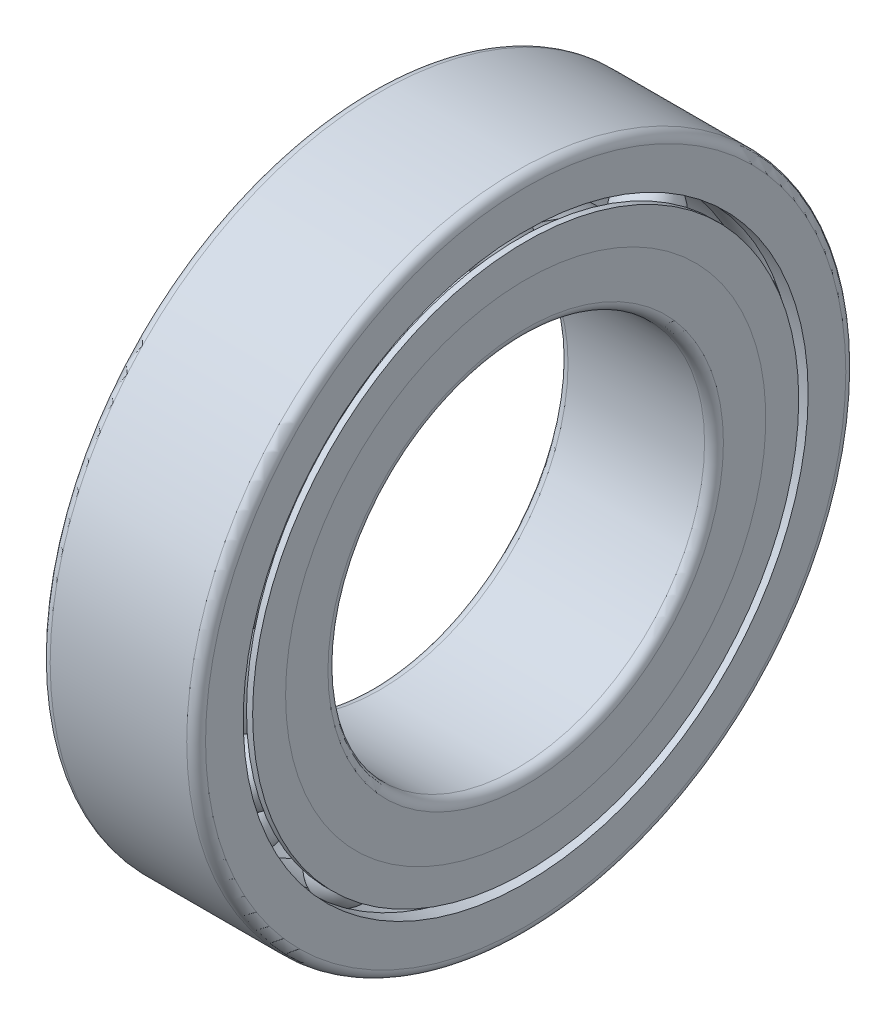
ISO-10303-21;
HEADER;
FILE_DESCRIPTION(('STEP AP214'),'2;1');
FILE_NAME('part.step','',(''),(''),'','','');
FILE_SCHEMA(('AUTOMOTIVE_DESIGN { 1 0 10303 214 1 1 1 1 }'));
ENDSEC;
DATA;
#1=APPLICATION_CONTEXT('core data for automotive mechanical design processes');
#2=APPLICATION_PROTOCOL_DEFINITION('international standard','automotive_design',2000,#1);
#3=PRODUCT_CONTEXT('',#1,'mechanical');
#4=PRODUCT('Part','Part','',(#3));
#5=PRODUCT_RELATED_PRODUCT_CATEGORY('part','',(#4));
#6=PRODUCT_DEFINITION_FORMATION('','',#4);
#7=PRODUCT_DEFINITION_CONTEXT('part definition',#1,'design');
#8=PRODUCT_DEFINITION('design','',#6,#7);
#9=PRODUCT_DEFINITION_SHAPE('','',#8);
#10=(LENGTH_UNIT() NAMED_UNIT(*) SI_UNIT(.MILLI.,.METRE.));
#11=(NAMED_UNIT(*) PLANE_ANGLE_UNIT() SI_UNIT($,.RADIAN.));
#12=(NAMED_UNIT(*) SI_UNIT($,.STERADIAN.) SOLID_ANGLE_UNIT());
#13=UNCERTAINTY_MEASURE_WITH_UNIT(LENGTH_MEASURE(1.E-05),#10,'distance_accuracy_value','');
#14=(GEOMETRIC_REPRESENTATION_CONTEXT(3) GLOBAL_UNCERTAINTY_ASSIGNED_CONTEXT((#13)) GLOBAL_UNIT_ASSIGNED_CONTEXT((#10,
#11,#12)) REPRESENTATION_CONTEXT('',''));
#15=CARTESIAN_POINT('',(0.,0.,0.));
#16=DIRECTION('',(0.,0.,1.));
#17=DIRECTION('',(1.,0.,0.));
#18=AXIS2_PLACEMENT_3D('',#15,#16,#17);
#19=CARTESIAN_POINT('',(0.,0.,0.));
#20=DIRECTION('',(1.,0.,0.));
#21=DIRECTION('',(0.,0.,1.));
#22=AXIS2_PLACEMENT_3D('',#19,#20,#21);
#23=CYLINDRICAL_SURFACE('',#22,58.);
#24=CARTESIAN_POINT('',(16.5,0.,0.));
#25=DIRECTION('',(-1.,0.,0.));
#26=DIRECTION('',(0.,0.,1.));
#27=AXIS2_PLACEMENT_3D('',#24,#25,#26);
#28=CIRCLE('',#27,58.);
#29=CARTESIAN_POINT('',(16.5,0.,58.));
#30=VERTEX_POINT('',#29);
#31=EDGE_CURVE('E50',#30,#30,#28,.T.);
#32=ORIENTED_EDGE('',*,*,#31,.T.);
#33=EDGE_LOOP('',(#32));
#34=FACE_BOUND('',#33,.T.);
#35=CARTESIAN_POINT('',(15.1961524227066,0.,0.));
#36=DIRECTION('',(-1.,0.,0.));
#37=DIRECTION('',(0.,0.,1.));
#38=AXIS2_PLACEMENT_3D('',#35,#36,#37);
#39=CIRCLE('',#38,58.);
#40=CARTESIAN_POINT('',(15.1961524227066,0.,58.));
#41=VERTEX_POINT('',#40);
#42=EDGE_CURVE('E11',#41,#41,#39,.T.);
#43=ORIENTED_EDGE('',*,*,#42,.F.);
#44=EDGE_LOOP('',(#43));
#45=FACE_BOUND('',#44,.T.);
#46=ADVANCED_FACE('F36',(#34,#45),#23,.T.);
#47=CARTESIAN_POINT('',(10.,0.,0.));
#48=DIRECTION('',(1.,0.,0.));
#49=DIRECTION('',(0.,0.,1.));
#50=AXIS2_PLACEMENT_3D('',#47,#48,#49);
#51=TOROIDAL_SURFACE('',#50,55.,6.);
#52=ORIENTED_EDGE('',*,*,#42,.T.);
#53=EDGE_LOOP('',(#52));
#54=FACE_BOUND('',#53,.T.);
#55=CARTESIAN_POINT('',(14.4721359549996,0.,0.));
#56=DIRECTION('',(-1.,0.,0.));
#57=DIRECTION('',(0.,0.,1.));
#58=AXIS2_PLACEMENT_3D('',#55,#56,#57);
#59=CIRCLE('',#58,51.);
#60=CARTESIAN_POINT('',(14.4721359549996,0.,51.));
#61=VERTEX_POINT('',#60);
#62=EDGE_CURVE('E42',#61,#61,#59,.T.);
#63=ORIENTED_EDGE('',*,*,#62,.F.);
#64=EDGE_LOOP('',(#63));
#65=FACE_BOUND('',#64,.T.);
#66=ADVANCED_FACE('F66',(#54,#65),#51,.F.);
#67=CARTESIAN_POINT('',(0.,0.,0.));
#68=DIRECTION('',(1.,0.,0.));
#69=DIRECTION('',(0.,0.,1.));
#70=AXIS2_PLACEMENT_3D('',#67,#68,#69);
#71=CYLINDRICAL_SURFACE('',#70,51.);
#72=ORIENTED_EDGE('',*,*,#62,.T.);
#73=EDGE_LOOP('',(#72));
#74=FACE_BOUND('',#73,.T.);
#75=CARTESIAN_POINT('',(16.5,0.,0.));
#76=DIRECTION('',(-1.,0.,0.));
#77=DIRECTION('',(0.,0.,1.));
#78=AXIS2_PLACEMENT_3D('',#75,#76,#77);
#79=CIRCLE('',#78,51.);
#80=CARTESIAN_POINT('',(16.5,0.,51.));
#81=VERTEX_POINT('',#80);
#82=EDGE_CURVE('E46',#81,#81,#79,.T.);
#83=ORIENTED_EDGE('',*,*,#82,.F.);
#84=EDGE_LOOP('',(#83));
#85=FACE_BOUND('',#84,.T.);
#86=ADVANCED_FACE('F60',(#74,#85),#71,.F.);
#87=CARTESIAN_POINT('',(16.5,58.,0.));
#88=DIRECTION('',(-1.,0.,0.));
#89=DIRECTION('',(0.,0.,-1.));
#90=AXIS2_PLACEMENT_3D('',#87,#88,#89);
#91=PLANE('',#90);
#92=ORIENTED_EDGE('',*,*,#82,.T.);
#93=EDGE_LOOP('',(#92));
#94=FACE_BOUND('',#93,.T.);
#95=ORIENTED_EDGE('',*,*,#31,.F.);
#96=EDGE_LOOP('',(#95));
#97=FACE_BOUND('',#96,.T.);
#98=ADVANCED_FACE('F58',(#94,#97),#91,.F.);
#99=CLOSED_SHELL('',(#46,#66,#86,#98));
#100=MANIFOLD_SOLID_BREP('B2',#99);
#101=CARTESIAN_POINT('',(-10.,44.4959346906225,32.3281888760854));
#102=DIRECTION('',(-1.,0.,0.));
#103=DIRECTION('',(0.,0.809016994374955,0.587785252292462));
#104=AXIS2_PLACEMENT_3D('',#101,#102,#103);
#105=SPHERICAL_SURFACE('',#104,6.);
#106=CARTESIAN_POINT('',(-16.,44.4959346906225,32.3281888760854));
#107=VERTEX_POINT('',#106);
#108=VERTEX_LOOP('',#107);
#109=FACE_BOUND('',#108,.T.);
#110=ADVANCED_FACE('F104',(#109),#105,.T.);
#111=CLOSED_SHELL('',(#110));
#112=MANIFOLD_SOLID_BREP('B6',#111);
#113=CARTESIAN_POINT('',(-10.,16.9959346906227,52.3081083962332));
#114=DIRECTION('',(-1.,0.,0.));
#115=DIRECTION('',(0.,0.309016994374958,0.95105651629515));
#116=AXIS2_PLACEMENT_3D('',#113,#114,#115);
#117=SPHERICAL_SURFACE('',#116,6.);
#118=CARTESIAN_POINT('',(-16.,16.9959346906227,52.3081083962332));
#119=VERTEX_POINT('',#118);
#120=VERTEX_LOOP('',#119);
#121=FACE_BOUND('',#120,.T.);
#122=ADVANCED_FACE('F123',(#121),#117,.T.);
#123=CLOSED_SHELL('',(#122));
#124=MANIFOLD_SOLID_BREP('B32',#123);
#125=CARTESIAN_POINT('',(-10.,-16.9959346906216,52.3081083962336));
#126=DIRECTION('',(-1.,0.,0.));
#127=DIRECTION('',(0.,-0.309016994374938,0.951056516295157));
#128=AXIS2_PLACEMENT_3D('',#125,#126,#127);
#129=SPHERICAL_SURFACE('',#128,6.);
#130=CARTESIAN_POINT('',(-16.,-16.9959346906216,52.3081083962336));
#131=VERTEX_POINT('',#130);
#132=VERTEX_LOOP('',#131);
#133=FACE_BOUND('',#132,.T.);
#134=ADVANCED_FACE('F142',(#133),#129,.T.);
#135=CLOSED_SHELL('',(#134));
#136=MANIFOLD_SOLID_BREP('B100',#135);
#137=CARTESIAN_POINT('',(-10.,-44.4959346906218,32.3281888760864));
#138=DIRECTION('',(-1.,0.,0.));
#139=DIRECTION('',(0.,-0.809016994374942,0.58778525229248));
#140=AXIS2_PLACEMENT_3D('',#137,#138,#139);
#141=SPHERICAL_SURFACE('',#140,6.);
#142=CARTESIAN_POINT('',(-16.,-44.4959346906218,32.3281888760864));
#143=VERTEX_POINT('',#142);
#144=VERTEX_LOOP('',#143);
#145=FACE_BOUND('',#144,.T.);
#146=ADVANCED_FACE('F161',(#145),#141,.T.);
#147=CLOSED_SHELL('',(#146));
#148=MANIFOLD_SOLID_BREP('B119',#147);
#149=CARTESIAN_POINT('',(-10.,-55.,3.84063169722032E-13));
#150=DIRECTION('',(-1.,0.,0.));
#151=DIRECTION('',(0.,-1.,0.));
#152=AXIS2_PLACEMENT_3D('',#149,#150,#151);
#153=SPHERICAL_SURFACE('',#152,6.);
#154=CARTESIAN_POINT('',(-16.,-55.,3.84063169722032E-13));
#155=VERTEX_POINT('',#154);
#156=VERTEX_LOOP('',#155);
#157=FACE_BOUND('',#156,.T.);
#158=ADVANCED_FACE('F180',(#157),#153,.T.);
#159=CLOSED_SHELL('',(#158));
#160=MANIFOLD_SOLID_BREP('B138',#159);
#161=CARTESIAN_POINT('',(-10.,-44.4959346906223,-32.3281888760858));
#162=DIRECTION('',(-1.,0.,0.));
#163=DIRECTION('',(0.,-0.809016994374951,-0.587785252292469));
#164=AXIS2_PLACEMENT_3D('',#161,#162,#163);
#165=SPHERICAL_SURFACE('',#164,6.);
#166=CARTESIAN_POINT('',(-16.,-44.4959346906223,-32.3281888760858));
#167=VERTEX_POINT('',#166);
#168=VERTEX_LOOP('',#167);
#169=FACE_BOUND('',#168,.T.);
#170=ADVANCED_FACE('F199',(#169),#165,.T.);
#171=CLOSED_SHELL('',(#170));
#172=MANIFOLD_SOLID_BREP('B157',#171);
#173=CARTESIAN_POINT('',(-10.,-16.9959346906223,-52.3081083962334));
#174=DIRECTION('',(-1.,0.,0.));
#175=DIRECTION('',(0.,-0.309016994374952,-0.951056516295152));
#176=AXIS2_PLACEMENT_3D('',#173,#174,#175);
#177=SPHERICAL_SURFACE('',#176,6.);
#178=CARTESIAN_POINT('',(-16.,-16.9959346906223,-52.3081083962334));
#179=VERTEX_POINT('',#178);
#180=VERTEX_LOOP('',#179);
#181=FACE_BOUND('',#180,.T.);
#182=ADVANCED_FACE('F218',(#181),#177,.T.);
#183=CLOSED_SHELL('',(#182));
#184=MANIFOLD_SOLID_BREP('B176',#183);
#185=CARTESIAN_POINT('',(-10.,16.995934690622,-52.3081083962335));
#186=DIRECTION('',(-1.,0.,0.));
#187=DIRECTION('',(0.,0.309016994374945,-0.951056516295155));
#188=AXIS2_PLACEMENT_3D('',#185,#186,#187);
#189=SPHERICAL_SURFACE('',#188,6.);
#190=CARTESIAN_POINT('',(-16.,16.995934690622,-52.3081083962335));
#191=VERTEX_POINT('',#190);
#192=VERTEX_LOOP('',#191);
#193=FACE_BOUND('',#192,.T.);
#194=ADVANCED_FACE('F237',(#193),#189,.T.);
#195=CLOSED_SHELL('',(#194));
#196=MANIFOLD_SOLID_BREP('B195',#195);
#197=CARTESIAN_POINT('',(-10.,44.4959346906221,-32.3281888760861));
#198=DIRECTION('',(-1.,0.,0.));
#199=DIRECTION('',(0.,0.809016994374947,-0.587785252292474));
#200=AXIS2_PLACEMENT_3D('',#197,#198,#199);
#201=SPHERICAL_SURFACE('',#200,6.);
#202=CARTESIAN_POINT('',(-16.,44.4959346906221,-32.3281888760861));
#203=VERTEX_POINT('',#202);
#204=VERTEX_LOOP('',#203);
#205=FACE_BOUND('',#204,.T.);
#206=ADVANCED_FACE('F256',(#205),#201,.T.);
#207=CLOSED_SHELL('',(#206));
#208=MANIFOLD_SOLID_BREP('B214',#207);
#209=CARTESIAN_POINT('',(10.,44.4959346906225,32.3281888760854));
#210=DIRECTION('',(-1.,0.,0.));
#211=DIRECTION('',(0.,0.809016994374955,0.587785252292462));
#212=AXIS2_PLACEMENT_3D('',#209,#210,#211);
#213=SPHERICAL_SURFACE('',#212,6.);
#214=CARTESIAN_POINT('',(4.,44.4959346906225,32.3281888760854));
#215=VERTEX_POINT('',#214);
#216=VERTEX_LOOP('',#215);
#217=FACE_BOUND('',#216,.T.);
#218=ADVANCED_FACE('F275',(#217),#213,.T.);
#219=CLOSED_SHELL('',(#218));
#220=MANIFOLD_SOLID_BREP('B233',#219);
#221=CARTESIAN_POINT('',(10.,16.9959346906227,52.3081083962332));
#222=DIRECTION('',(-1.,0.,0.));
#223=DIRECTION('',(0.,0.309016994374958,0.95105651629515));
#224=AXIS2_PLACEMENT_3D('',#221,#222,#223);
#225=SPHERICAL_SURFACE('',#224,6.);
#226=CARTESIAN_POINT('',(4.,16.9959346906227,52.3081083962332));
#227=VERTEX_POINT('',#226);
#228=VERTEX_LOOP('',#227);
#229=FACE_BOUND('',#228,.T.);
#230=ADVANCED_FACE('F294',(#229),#225,.T.);
#231=CLOSED_SHELL('',(#230));
#232=MANIFOLD_SOLID_BREP('B252',#231);
#233=CARTESIAN_POINT('',(10.,-16.9959346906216,52.3081083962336));
#234=DIRECTION('',(-1.,0.,0.));
#235=DIRECTION('',(0.,-0.309016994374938,0.951056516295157));
#236=AXIS2_PLACEMENT_3D('',#233,#234,#235);
#237=SPHERICAL_SURFACE('',#236,6.);
#238=CARTESIAN_POINT('',(4.,-16.9959346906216,52.3081083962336));
#239=VERTEX_POINT('',#238);
#240=VERTEX_LOOP('',#239);
#241=FACE_BOUND('',#240,.T.);
#242=ADVANCED_FACE('F313',(#241),#237,.T.);
#243=CLOSED_SHELL('',(#242));
#244=MANIFOLD_SOLID_BREP('B271',#243);
#245=CARTESIAN_POINT('',(10.,-44.4959346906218,32.3281888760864));
#246=DIRECTION('',(-1.,0.,0.));
#247=DIRECTION('',(0.,-0.809016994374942,0.58778525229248));
#248=AXIS2_PLACEMENT_3D('',#245,#246,#247);
#249=SPHERICAL_SURFACE('',#248,6.);
#250=CARTESIAN_POINT('',(4.,-44.4959346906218,32.3281888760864));
#251=VERTEX_POINT('',#250);
#252=VERTEX_LOOP('',#251);
#253=FACE_BOUND('',#252,.T.);
#254=ADVANCED_FACE('F332',(#253),#249,.T.);
#255=CLOSED_SHELL('',(#254));
#256=MANIFOLD_SOLID_BREP('B290',#255);
#257=CARTESIAN_POINT('',(10.,-55.,3.84063169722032E-13));
#258=DIRECTION('',(-1.,0.,0.));
#259=DIRECTION('',(0.,-1.,0.));
#260=AXIS2_PLACEMENT_3D('',#257,#258,#259);
#261=SPHERICAL_SURFACE('',#260,6.);
#262=CARTESIAN_POINT('',(4.,-55.,3.84063169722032E-13));
#263=VERTEX_POINT('',#262);
#264=VERTEX_LOOP('',#263);
#265=FACE_BOUND('',#264,.T.);
#266=ADVANCED_FACE('F351',(#265),#261,.T.);
#267=CLOSED_SHELL('',(#266));
#268=MANIFOLD_SOLID_BREP('B309',#267);
#269=CARTESIAN_POINT('',(10.,-44.4959346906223,-32.3281888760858));
#270=DIRECTION('',(-1.,0.,0.));
#271=DIRECTION('',(0.,-0.809016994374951,-0.587785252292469));
#272=AXIS2_PLACEMENT_3D('',#269,#270,#271);
#273=SPHERICAL_SURFACE('',#272,6.);
#274=CARTESIAN_POINT('',(4.,-44.4959346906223,-32.3281888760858));
#275=VERTEX_POINT('',#274);
#276=VERTEX_LOOP('',#275);
#277=FACE_BOUND('',#276,.T.);
#278=ADVANCED_FACE('F370',(#277),#273,.T.);
#279=CLOSED_SHELL('',(#278));
#280=MANIFOLD_SOLID_BREP('B328',#279);
#281=CARTESIAN_POINT('',(10.,-16.9959346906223,-52.3081083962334));
#282=DIRECTION('',(-1.,0.,0.));
#283=DIRECTION('',(0.,-0.309016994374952,-0.951056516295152));
#284=AXIS2_PLACEMENT_3D('',#281,#282,#283);
#285=SPHERICAL_SURFACE('',#284,6.);
#286=CARTESIAN_POINT('',(4.,-16.9959346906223,-52.3081083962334));
#287=VERTEX_POINT('',#286);
#288=VERTEX_LOOP('',#287);
#289=FACE_BOUND('',#288,.T.);
#290=ADVANCED_FACE('F389',(#289),#285,.T.);
#291=CLOSED_SHELL('',(#290));
#292=MANIFOLD_SOLID_BREP('B347',#291);
#293=CARTESIAN_POINT('',(10.,16.995934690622,-52.3081083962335));
#294=DIRECTION('',(-1.,0.,0.));
#295=DIRECTION('',(0.,0.309016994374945,-0.951056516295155));
#296=AXIS2_PLACEMENT_3D('',#293,#294,#295);
#297=SPHERICAL_SURFACE('',#296,6.);
#298=CARTESIAN_POINT('',(4.,16.995934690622,-52.3081083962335));
#299=VERTEX_POINT('',#298);
#300=VERTEX_LOOP('',#299);
#301=FACE_BOUND('',#300,.T.);
#302=ADVANCED_FACE('F408',(#301),#297,.T.);
#303=CLOSED_SHELL('',(#302));
#304=MANIFOLD_SOLID_BREP('B366',#303);
#305=CARTESIAN_POINT('',(10.,44.4959346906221,-32.3281888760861));
#306=DIRECTION('',(-1.,0.,0.));
#307=DIRECTION('',(0.,0.809016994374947,-0.587785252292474));
#308=AXIS2_PLACEMENT_3D('',#305,#306,#307);
#309=SPHERICAL_SURFACE('',#308,6.);
#310=CARTESIAN_POINT('',(4.,44.4959346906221,-32.3281888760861));
#311=VERTEX_POINT('',#310);
#312=VERTEX_LOOP('',#311);
#313=FACE_BOUND('',#312,.T.);
#314=ADVANCED_FACE('F429',(#313),#309,.T.);
#315=CLOSED_SHELL('',(#314));
#316=MANIFOLD_SOLID_BREP('B385',#315);
#317=CARTESIAN_POINT('',(0.,0.,0.));
#318=DIRECTION('',(-1.,0.,0.));
#319=DIRECTION('',(0.,0.,1.));
#320=AXIS2_PLACEMENT_3D('',#317,#318,#319);
#321=CYLINDRICAL_SURFACE('',#320,58.);
#322=CARTESIAN_POINT('',(-16.5,0.,0.));
#323=DIRECTION('',(-1.,0.,0.));
#324=DIRECTION('',(0.,0.,1.));
#325=AXIS2_PLACEMENT_3D('',#322,#323,#324);
#326=CIRCLE('',#325,58.);
#327=CARTESIAN_POINT('',(-16.5,0.,58.));
#328=VERTEX_POINT('',#327);
#329=EDGE_CURVE('E462',#328,#328,#326,.T.);
#330=ORIENTED_EDGE('',*,*,#329,.F.);
#331=EDGE_LOOP('',(#330));
#332=FACE_BOUND('',#331,.T.);
#333=CARTESIAN_POINT('',(-15.1961524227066,0.,0.));
#334=DIRECTION('',(-1.,0.,0.));
#335=DIRECTION('',(0.,0.,1.));
#336=AXIS2_PLACEMENT_3D('',#333,#334,#335);
#337=CIRCLE('',#336,58.);
#338=CARTESIAN_POINT('',(-15.1961524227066,0.,58.));
#339=VERTEX_POINT('',#338);
#340=EDGE_CURVE('E428',#339,#339,#337,.T.);
#341=ORIENTED_EDGE('',*,*,#340,.T.);
#342=EDGE_LOOP('',(#341));
#343=FACE_BOUND('',#342,.T.);
#344=ADVANCED_FACE('F448',(#332,#343),#321,.T.);
#345=CARTESIAN_POINT('',(-10.,0.,0.));
#346=DIRECTION('',(-1.,0.,0.));
#347=DIRECTION('',(0.,0.,1.));
#348=AXIS2_PLACEMENT_3D('',#345,#346,#347);
#349=TOROIDAL_SURFACE('',#348,55.,6.);
#350=ORIENTED_EDGE('',*,*,#340,.F.);
#351=EDGE_LOOP('',(#350));
#352=FACE_BOUND('',#351,.T.);
#353=CARTESIAN_POINT('',(-14.4721359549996,0.,0.));
#354=DIRECTION('',(-1.,0.,0.));
#355=DIRECTION('',(0.,0.,1.));
#356=AXIS2_PLACEMENT_3D('',#353,#354,#355);
#357=CIRCLE('',#356,51.);
#358=CARTESIAN_POINT('',(-14.4721359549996,0.,51.));
#359=VERTEX_POINT('',#358);
#360=EDGE_CURVE('E454',#359,#359,#357,.T.);
#361=ORIENTED_EDGE('',*,*,#360,.T.);
#362=EDGE_LOOP('',(#361));
#363=FACE_BOUND('',#362,.T.);
#364=ADVANCED_FACE('F471',(#352,#363),#349,.F.);
#365=CARTESIAN_POINT('',(0.,0.,0.));
#366=DIRECTION('',(-1.,0.,0.));
#367=DIRECTION('',(0.,0.,1.));
#368=AXIS2_PLACEMENT_3D('',#365,#366,#367);
#369=CYLINDRICAL_SURFACE('',#368,51.);
#370=ORIENTED_EDGE('',*,*,#360,.F.);
#371=EDGE_LOOP('',(#370));
#372=FACE_BOUND('',#371,.T.);
#373=CARTESIAN_POINT('',(-16.5,0.,0.));
#374=DIRECTION('',(-1.,0.,0.));
#375=DIRECTION('',(0.,0.,1.));
#376=AXIS2_PLACEMENT_3D('',#373,#374,#375);
#377=CIRCLE('',#376,51.);
#378=CARTESIAN_POINT('',(-16.5,0.,51.));
#379=VERTEX_POINT('',#378);
#380=EDGE_CURVE('E458',#379,#379,#377,.T.);
#381=ORIENTED_EDGE('',*,*,#380,.T.);
#382=EDGE_LOOP('',(#381));
#383=FACE_BOUND('',#382,.T.);
#384=ADVANCED_FACE('F475',(#372,#383),#369,.F.);
#385=CARTESIAN_POINT('',(-16.5,58.,0.));
#386=DIRECTION('',(1.,0.,0.));
#387=DIRECTION('',(0.,0.,-1.));
#388=AXIS2_PLACEMENT_3D('',#385,#386,#387);
#389=PLANE('',#388);
#390=ORIENTED_EDGE('',*,*,#380,.F.);
#391=EDGE_LOOP('',(#390));
#392=FACE_BOUND('',#391,.T.);
#393=ORIENTED_EDGE('',*,*,#329,.T.);
#394=EDGE_LOOP('',(#393));
#395=FACE_BOUND('',#394,.T.);
#396=ADVANCED_FACE('F468',(#392,#395),#389,.F.);
#397=CLOSED_SHELL('',(#344,#364,#384,#396));
#398=MANIFOLD_SOLID_BREP('B404',#397);
#399=CARTESIAN_POINT('',(10.,55.,0.));
#400=DIRECTION('',(-1.,0.,0.));
#401=DIRECTION('',(0.,1.,0.));
#402=AXIS2_PLACEMENT_3D('',#399,#400,#401);
#403=SPHERICAL_SURFACE('',#402,6.);
#404=CARTESIAN_POINT('',(4.,55.,0.));
#405=VERTEX_POINT('',#404);
#406=VERTEX_LOOP('',#405);
#407=FACE_BOUND('',#406,.T.);
#408=ADVANCED_FACE('F516',(#407),#403,.T.);
#409=CLOSED_SHELL('',(#408));
#410=MANIFOLD_SOLID_BREP('B423',#409);
#411=CARTESIAN_POINT('',(-10.,55.,0.));
#412=DIRECTION('',(-1.,0.,0.));
#413=DIRECTION('',(0.,1.,0.));
#414=AXIS2_PLACEMENT_3D('',#411,#412,#413);
#415=SPHERICAL_SURFACE('',#414,6.);
#416=CARTESIAN_POINT('',(-16.,55.,0.));
#417=VERTEX_POINT('',#416);
#418=VERTEX_LOOP('',#417);
#419=FACE_BOUND('',#418,.T.);
#420=ADVANCED_FACE('F537',(#419),#415,.T.);
#421=CLOSED_SHELL('',(#420));
#422=MANIFOLD_SOLID_BREP('B444',#421);
#423=CARTESIAN_POINT('',(-14.5,0.,0.));
#424=DIRECTION('',(1.,0.,0.));
#425=DIRECTION('',(0.,0.,-1.));
#426=AXIS2_PLACEMENT_3D('',#423,#424,#425);
#427=TOROIDAL_SURFACE('',#426,68.,2.);
#428=CARTESIAN_POINT('',(-16.5,0.,0.));
#429=DIRECTION('',(1.,0.,0.));
#430=DIRECTION('',(0.,0.,-1.));
#431=AXIS2_PLACEMENT_3D('',#428,#429,#430);
#432=CIRCLE('',#431,68.);
#433=CARTESIAN_POINT('',(-16.5,0.,-68.));
#434=VERTEX_POINT('',#433);
#435=EDGE_CURVE('E536',#434,#434,#432,.T.);
#436=ORIENTED_EDGE('',*,*,#435,.T.);
#437=EDGE_LOOP('',(#436));
#438=FACE_BOUND('',#437,.T.);
#439=CARTESIAN_POINT('',(-14.5,0.,0.));
#440=DIRECTION('',(1.,0.,0.));
#441=DIRECTION('',(0.,0.,-1.));
#442=AXIS2_PLACEMENT_3D('',#439,#440,#441);
#443=CIRCLE('',#442,70.);
#444=CARTESIAN_POINT('',(-14.5,0.,-70.));
#445=VERTEX_POINT('',#444);
#446=EDGE_CURVE('E591',#445,#445,#443,.T.);
#447=ORIENTED_EDGE('',*,*,#446,.F.);
#448=EDGE_LOOP('',(#447));
#449=FACE_BOUND('',#448,.T.);
#450=ADVANCED_FACE('F557',(#438,#449),#427,.T.);
#451=CARTESIAN_POINT('',(-16.5,68.,0.));
#452=DIRECTION('',(-1.,0.,0.));
#453=DIRECTION('',(0.,0.,1.));
#454=AXIS2_PLACEMENT_3D('',#451,#452,#453);
#455=PLANE('',#454);
#456=CARTESIAN_POINT('',(-16.5,0.,0.));
#457=DIRECTION('',(1.,0.,0.));
#458=DIRECTION('',(0.,0.,-1.));
#459=AXIS2_PLACEMENT_3D('',#456,#457,#458);
#460=CIRCLE('',#459,60.);
#461=CARTESIAN_POINT('',(-16.5,0.,-60.));
#462=VERTEX_POINT('',#461);
#463=EDGE_CURVE('E563',#462,#462,#460,.T.);
#464=ORIENTED_EDGE('',*,*,#463,.T.);
#465=EDGE_LOOP('',(#464));
#466=FACE_BOUND('',#465,.T.);
#467=ORIENTED_EDGE('',*,*,#435,.F.);
#468=EDGE_LOOP('',(#467));
#469=FACE_BOUND('',#468,.T.);
#470=ADVANCED_FACE('F599',(#466,#469),#455,.T.);
#471=CARTESIAN_POINT('',(23.,0.,0.));
#472=DIRECTION('',(1.,0.,0.));
#473=DIRECTION('',(0.,0.,-1.));
#474=AXIS2_PLACEMENT_3D('',#471,#472,#473);
#475=CYLINDRICAL_SURFACE('',#474,60.);
#476=CARTESIAN_POINT('',(-13.268767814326,0.,0.));
#477=DIRECTION('',(1.,0.,0.));
#478=DIRECTION('',(0.,0.,-1.));
#479=AXIS2_PLACEMENT_3D('',#476,#477,#478);
#480=CIRCLE('',#479,60.);
#481=CARTESIAN_POINT('',(-13.268767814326,0.,-60.));
#482=VERTEX_POINT('',#481);
#483=EDGE_CURVE('E567',#482,#482,#480,.T.);
#484=ORIENTED_EDGE('',*,*,#483,.T.);
#485=EDGE_LOOP('',(#484));
#486=FACE_BOUND('',#485,.T.);
#487=ORIENTED_EDGE('',*,*,#463,.F.);
#488=EDGE_LOOP('',(#487));
#489=FACE_BOUND('',#488,.T.);
#490=ADVANCED_FACE('F603',(#486,#489),#475,.F.);
#491=CARTESIAN_POINT('',(-9.99997534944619,0.,0.));
#492=DIRECTION('',(1.,0.,0.));
#493=DIRECTION('',(0.,0.,-1.));
#494=AXIS2_PLACEMENT_3D('',#491,#492,#493);
#495=TOROIDAL_SURFACE('',#494,54.96859902,6.);
#496=CARTESIAN_POINT('',(-6.73118288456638,0.,0.));
#497=DIRECTION('',(1.,0.,0.));
#498=DIRECTION('',(0.,0.,-1.));
#499=AXIS2_PLACEMENT_3D('',#496,#497,#498);
#500=CIRCLE('',#499,60.);
#501=CARTESIAN_POINT('',(-6.73118288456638,0.,-60.));
#502=VERTEX_POINT('',#501);
#503=EDGE_CURVE('E571',#502,#502,#500,.T.);
#504=ORIENTED_EDGE('',*,*,#503,.T.);
#505=EDGE_LOOP('',(#504));
#506=FACE_BOUND('',#505,.T.);
#507=ORIENTED_EDGE('',*,*,#483,.F.);
#508=EDGE_LOOP('',(#507));
#509=FACE_BOUND('',#508,.T.);
#510=ADVANCED_FACE('F607',(#506,#509),#495,.F.);
#511=CARTESIAN_POINT('',(23.,0.,0.));
#512=DIRECTION('',(1.,0.,0.));
#513=DIRECTION('',(0.,0.,-1.));
#514=AXIS2_PLACEMENT_3D('',#511,#512,#513);
#515=CYLINDRICAL_SURFACE('',#514,60.);
#516=CARTESIAN_POINT('',(6.6833752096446,0.,0.));
#517=DIRECTION('',(1.,0.,0.));
#518=DIRECTION('',(0.,0.,-1.));
#519=AXIS2_PLACEMENT_3D('',#516,#517,#518);
#520=CIRCLE('',#519,60.);
#521=CARTESIAN_POINT('',(6.6833752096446,0.,-60.));
#522=VERTEX_POINT('',#521);
#523=EDGE_CURVE('E576',#522,#522,#520,.T.);
#524=ORIENTED_EDGE('',*,*,#523,.T.);
#525=EDGE_LOOP('',(#524));
#526=FACE_BOUND('',#525,.T.);
#527=ORIENTED_EDGE('',*,*,#503,.F.);
#528=EDGE_LOOP('',(#527));
#529=FACE_BOUND('',#528,.T.);
#530=ADVANCED_FACE('F614',(#526,#529),#515,.F.);
#531=CARTESIAN_POINT('',(10.,0.,0.));
#532=DIRECTION('',(1.,0.,0.));
#533=DIRECTION('',(0.,0.,-1.));
#534=AXIS2_PLACEMENT_3D('',#531,#532,#533);
#535=TOROIDAL_SURFACE('',#534,55.,6.);
#536=CARTESIAN_POINT('',(13.3166247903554,0.,0.));
#537=DIRECTION('',(1.,0.,0.));
#538=DIRECTION('',(0.,0.,-1.));
#539=AXIS2_PLACEMENT_3D('',#536,#537,#538);
#540=CIRCLE('',#539,60.);
#541=CARTESIAN_POINT('',(13.3166247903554,0.,-60.));
#542=VERTEX_POINT('',#541);
#543=EDGE_CURVE('E579',#542,#542,#540,.T.);
#544=ORIENTED_EDGE('',*,*,#543,.T.);
#545=EDGE_LOOP('',(#544));
#546=FACE_BOUND('',#545,.T.);
#547=ORIENTED_EDGE('',*,*,#523,.F.);
#548=EDGE_LOOP('',(#547));
#549=FACE_BOUND('',#548,.T.);
#550=ADVANCED_FACE('F618',(#546,#549),#535,.F.);
#551=CARTESIAN_POINT('',(23.,0.,0.));
#552=DIRECTION('',(1.,0.,0.));
#553=DIRECTION('',(0.,0.,-1.));
#554=AXIS2_PLACEMENT_3D('',#551,#552,#553);
#555=CYLINDRICAL_SURFACE('',#554,60.);
#556=CARTESIAN_POINT('',(16.5,0.,0.));
#557=DIRECTION('',(1.,0.,0.));
#558=DIRECTION('',(0.,0.,-1.));
#559=AXIS2_PLACEMENT_3D('',#556,#557,#558);
#560=CIRCLE('',#559,60.);
#561=CARTESIAN_POINT('',(16.5,0.,-60.));
#562=VERTEX_POINT('',#561);
#563=EDGE_CURVE('E582',#562,#562,#560,.T.);
#564=ORIENTED_EDGE('',*,*,#563,.T.);
#565=EDGE_LOOP('',(#564));
#566=FACE_BOUND('',#565,.T.);
#567=ORIENTED_EDGE('',*,*,#543,.F.);
#568=EDGE_LOOP('',(#567));
#569=FACE_BOUND('',#568,.T.);
#570=ADVANCED_FACE('F622',(#566,#569),#555,.F.);
#571=CARTESIAN_POINT('',(16.5,60.,0.));
#572=DIRECTION('',(1.,0.,0.));
#573=DIRECTION('',(0.,0.,-1.));
#574=AXIS2_PLACEMENT_3D('',#571,#572,#573);
#575=PLANE('',#574);
#576=CARTESIAN_POINT('',(16.5,0.,0.));
#577=DIRECTION('',(1.,0.,0.));
#578=DIRECTION('',(0.,0.,-1.));
#579=AXIS2_PLACEMENT_3D('',#576,#577,#578);
#580=CIRCLE('',#579,68.);
#581=CARTESIAN_POINT('',(16.5,0.,-68.));
#582=VERTEX_POINT('',#581);
#583=EDGE_CURVE('E585',#582,#582,#580,.T.);
#584=ORIENTED_EDGE('',*,*,#583,.T.);
#585=EDGE_LOOP('',(#584));
#586=FACE_BOUND('',#585,.T.);
#587=ORIENTED_EDGE('',*,*,#563,.F.);
#588=EDGE_LOOP('',(#587));
#589=FACE_BOUND('',#588,.T.);
#590=ADVANCED_FACE('F626',(#586,#589),#575,.T.);
#591=CARTESIAN_POINT('',(14.5,0.,0.));
#592=DIRECTION('',(1.,0.,0.));
#593=DIRECTION('',(0.,0.,-1.));
#594=AXIS2_PLACEMENT_3D('',#591,#592,#593);
#595=TOROIDAL_SURFACE('',#594,68.,2.);
#596=CARTESIAN_POINT('',(14.5,0.,0.));
#597=DIRECTION('',(1.,0.,0.));
#598=DIRECTION('',(0.,0.,-1.));
#599=AXIS2_PLACEMENT_3D('',#596,#597,#598);
#600=CIRCLE('',#599,70.);
#601=CARTESIAN_POINT('',(14.5,0.,-70.));
#602=VERTEX_POINT('',#601);
#603=EDGE_CURVE('E588',#602,#602,#600,.T.);
#604=ORIENTED_EDGE('',*,*,#603,.T.);
#605=EDGE_LOOP('',(#604));
#606=FACE_BOUND('',#605,.T.);
#607=ORIENTED_EDGE('',*,*,#583,.F.);
#608=EDGE_LOOP('',(#607));
#609=FACE_BOUND('',#608,.T.);
#610=ADVANCED_FACE('F630',(#606,#609),#595,.T.);
#611=CARTESIAN_POINT('',(23.,0.,0.));
#612=DIRECTION('',(1.,0.,0.));
#613=DIRECTION('',(0.,0.,-1.));
#614=AXIS2_PLACEMENT_3D('',#611,#612,#613);
#615=CYLINDRICAL_SURFACE('',#614,70.);
#616=ORIENTED_EDGE('',*,*,#446,.T.);
#617=EDGE_LOOP('',(#616));
#618=FACE_BOUND('',#617,.T.);
#619=ORIENTED_EDGE('',*,*,#603,.F.);
#620=EDGE_LOOP('',(#619));
#621=FACE_BOUND('',#620,.T.);
#622=ADVANCED_FACE('F595',(#618,#621),#615,.T.);
#623=CLOSED_SHELL('',(#450,#470,#490,#510,#530,#550,#570,#590,#610,#622));
#624=MANIFOLD_SOLID_BREP('B512',#623);
#625=CARTESIAN_POINT('',(23.,0.,0.));
#626=DIRECTION('',(-1.,0.,0.));
#627=DIRECTION('',(0.,0.,1.));
#628=AXIS2_PLACEMENT_3D('',#625,#626,#627);
#629=CYLINDRICAL_SURFACE('',#628,51.);
#630=CARTESIAN_POINT('',(-16.5,0.,0.));
#631=DIRECTION('',(-1.,0.,0.));
#632=DIRECTION('',(0.,0.,1.));
#633=AXIS2_PLACEMENT_3D('',#630,#631,#632);
#634=CIRCLE('',#633,51.);
#635=CARTESIAN_POINT('',(-16.5,0.,51.));
#636=VERTEX_POINT('',#635);
#637=EDGE_CURVE('E556',#636,#636,#634,.T.);
#638=ORIENTED_EDGE('',*,*,#637,.F.);
#639=EDGE_LOOP('',(#638));
#640=FACE_BOUND('',#639,.T.);
#641=CARTESIAN_POINT('',(-14.4721359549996,0.,0.));
#642=DIRECTION('',(-1.,0.,0.));
#643=DIRECTION('',(0.,0.,1.));
#644=AXIS2_PLACEMENT_3D('',#641,#642,#643);
#645=CIRCLE('',#644,51.);
#646=CARTESIAN_POINT('',(-14.4721359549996,0.,51.));
#647=VERTEX_POINT('',#646);
#648=EDGE_CURVE('E743',#647,#647,#645,.T.);
#649=ORIENTED_EDGE('',*,*,#648,.T.);
#650=EDGE_LOOP('',(#649));
#651=FACE_BOUND('',#650,.T.);
#652=ADVANCED_FACE('F709',(#640,#651),#629,.T.);
#653=CARTESIAN_POINT('',(-16.5,51.,0.));
#654=DIRECTION('',(1.,0.,0.));
#655=DIRECTION('',(0.,0.,-1.));
#656=AXIS2_PLACEMENT_3D('',#653,#654,#655);
#657=PLANE('',#656);
#658=CARTESIAN_POINT('',(-16.5,0.,0.));
#659=DIRECTION('',(-1.,0.,0.));
#660=DIRECTION('',(0.,0.,1.));
#661=AXIS2_PLACEMENT_3D('',#658,#659,#660);
#662=CIRCLE('',#661,42.);
#663=CARTESIAN_POINT('',(-16.5,0.,42.));
#664=VERTEX_POINT('',#663);
#665=EDGE_CURVE('E715',#664,#664,#662,.T.);
#666=ORIENTED_EDGE('',*,*,#665,.F.);
#667=EDGE_LOOP('',(#666));
#668=FACE_BOUND('',#667,.T.);
#669=ORIENTED_EDGE('',*,*,#637,.T.);
#670=EDGE_LOOP('',(#669));
#671=FACE_BOUND('',#670,.T.);
#672=ADVANCED_FACE('F792',(#668,#671),#657,.F.);
#673=CARTESIAN_POINT('',(-14.5,0.,0.));
#674=DIRECTION('',(-1.,0.,0.));
#675=DIRECTION('',(0.,0.,1.));
#676=AXIS2_PLACEMENT_3D('',#673,#674,#675);
#677=TOROIDAL_SURFACE('',#676,42.,1.99999999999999);
#678=CARTESIAN_POINT('',(-14.5,0.,0.));
#679=DIRECTION('',(-1.,0.,0.));
#680=DIRECTION('',(0.,0.,1.));
#681=AXIS2_PLACEMENT_3D('',#678,#679,#680);
#682=CIRCLE('',#681,40.);
#683=CARTESIAN_POINT('',(-14.5,0.,40.));
#684=VERTEX_POINT('',#683);
#685=EDGE_CURVE('E719',#684,#684,#682,.T.);
#686=ORIENTED_EDGE('',*,*,#685,.F.);
#687=EDGE_LOOP('',(#686));
#688=FACE_BOUND('',#687,.T.);
#689=ORIENTED_EDGE('',*,*,#665,.T.);
#690=EDGE_LOOP('',(#689));
#691=FACE_BOUND('',#690,.T.);
#692=ADVANCED_FACE('F787',(#688,#691),#677,.T.);
#693=CARTESIAN_POINT('',(23.,0.,0.));
#694=DIRECTION('',(-1.,0.,0.));
#695=DIRECTION('',(0.,0.,1.));
#696=AXIS2_PLACEMENT_3D('',#693,#694,#695);
#697=CYLINDRICAL_SURFACE('',#696,40.);
#698=CARTESIAN_POINT('',(14.5,0.,0.));
#699=DIRECTION('',(-1.,0.,0.));
#700=DIRECTION('',(0.,0.,1.));
#701=AXIS2_PLACEMENT_3D('',#698,#699,#700);
#702=CIRCLE('',#701,40.);
#703=CARTESIAN_POINT('',(14.5,0.,40.));
#704=VERTEX_POINT('',#703);
#705=EDGE_CURVE('E723',#704,#704,#702,.T.);
#706=ORIENTED_EDGE('',*,*,#705,.F.);
#707=EDGE_LOOP('',(#706));
#708=FACE_BOUND('',#707,.T.);
#709=ORIENTED_EDGE('',*,*,#685,.T.);
#710=EDGE_LOOP('',(#709));
#711=FACE_BOUND('',#710,.T.);
#712=ADVANCED_FACE('F781',(#708,#711),#697,.F.);
#713=CARTESIAN_POINT('',(14.5,0.,0.));
#714=DIRECTION('',(-1.,0.,0.));
#715=DIRECTION('',(0.,0.,1.));
#716=AXIS2_PLACEMENT_3D('',#713,#714,#715);
#717=TOROIDAL_SURFACE('',#716,42.,1.99999999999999);
#718=CARTESIAN_POINT('',(16.5,0.,0.));
#719=DIRECTION('',(-1.,0.,0.));
#720=DIRECTION('',(0.,0.,1.));
#721=AXIS2_PLACEMENT_3D('',#718,#719,#720);
#722=CIRCLE('',#721,42.);
#723=CARTESIAN_POINT('',(16.5,0.,42.));
#724=VERTEX_POINT('',#723);
#725=EDGE_CURVE('E728',#724,#724,#722,.T.);
#726=ORIENTED_EDGE('',*,*,#725,.F.);
#727=EDGE_LOOP('',(#726));
#728=FACE_BOUND('',#727,.T.);
#729=ORIENTED_EDGE('',*,*,#705,.T.);
#730=EDGE_LOOP('',(#729));
#731=FACE_BOUND('',#730,.T.);
#732=ADVANCED_FACE('F775',(#728,#731),#717,.T.);
#733=CARTESIAN_POINT('',(16.5,42.,0.));
#734=DIRECTION('',(-1.,0.,0.));
#735=DIRECTION('',(0.,0.,1.));
#736=AXIS2_PLACEMENT_3D('',#733,#734,#735);
#737=PLANE('',#736);
#738=CARTESIAN_POINT('',(16.5,0.,0.));
#739=DIRECTION('',(-1.,0.,0.));
#740=DIRECTION('',(0.,0.,1.));
#741=AXIS2_PLACEMENT_3D('',#738,#739,#740);
#742=CIRCLE('',#741,51.);
#743=CARTESIAN_POINT('',(16.5,0.,51.));
#744=VERTEX_POINT('',#743);
#745=EDGE_CURVE('E731',#744,#744,#742,.T.);
#746=ORIENTED_EDGE('',*,*,#745,.F.);
#747=EDGE_LOOP('',(#746));
#748=FACE_BOUND('',#747,.T.);
#749=ORIENTED_EDGE('',*,*,#725,.T.);
#750=EDGE_LOOP('',(#749));
#751=FACE_BOUND('',#750,.T.);
#752=ADVANCED_FACE('F769',(#748,#751),#737,.F.);
#753=CARTESIAN_POINT('',(23.,0.,0.));
#754=DIRECTION('',(-1.,0.,0.));
#755=DIRECTION('',(0.,0.,1.));
#756=AXIS2_PLACEMENT_3D('',#753,#754,#755);
#757=CYLINDRICAL_SURFACE('',#756,51.);
#758=CARTESIAN_POINT('',(14.4721359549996,0.,0.));
#759=DIRECTION('',(-1.,0.,0.));
#760=DIRECTION('',(0.,0.,1.));
#761=AXIS2_PLACEMENT_3D('',#758,#759,#760);
#762=CIRCLE('',#761,51.);
#763=CARTESIAN_POINT('',(14.4721359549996,0.,51.));
#764=VERTEX_POINT('',#763);
#765=EDGE_CURVE('E734',#764,#764,#762,.T.);
#766=ORIENTED_EDGE('',*,*,#765,.F.);
#767=EDGE_LOOP('',(#766));
#768=FACE_BOUND('',#767,.T.);
#769=ORIENTED_EDGE('',*,*,#745,.T.);
#770=EDGE_LOOP('',(#769));
#771=FACE_BOUND('',#770,.T.);
#772=ADVANCED_FACE('F763',(#768,#771),#757,.T.);
#773=CARTESIAN_POINT('',(10.,0.,0.));
#774=DIRECTION('',(-1.,0.,0.));
#775=DIRECTION('',(0.,0.,1.));
#776=AXIS2_PLACEMENT_3D('',#773,#774,#775);
#777=TOROIDAL_SURFACE('',#776,55.,6.);
#778=CARTESIAN_POINT('',(5.52786404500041,0.,0.));
#779=DIRECTION('',(-1.,0.,0.));
#780=DIRECTION('',(0.,0.,1.));
#781=AXIS2_PLACEMENT_3D('',#778,#779,#780);
#782=CIRCLE('',#781,51.);
#783=CARTESIAN_POINT('',(5.52786404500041,0.,51.));
#784=VERTEX_POINT('',#783);
#785=EDGE_CURVE('E737',#784,#784,#782,.T.);
#786=ORIENTED_EDGE('',*,*,#785,.F.);
#787=EDGE_LOOP('',(#786));
#788=FACE_BOUND('',#787,.T.);
#789=ORIENTED_EDGE('',*,*,#765,.T.);
#790=EDGE_LOOP('',(#789));
#791=FACE_BOUND('',#790,.T.);
#792=ADVANCED_FACE('F757',(#788,#791),#777,.F.);
#793=CARTESIAN_POINT('',(23.,0.,0.));
#794=DIRECTION('',(-1.,0.,0.));
#795=DIRECTION('',(0.,0.,1.));
#796=AXIS2_PLACEMENT_3D('',#793,#794,#795);
#797=CYLINDRICAL_SURFACE('',#796,51.);
#798=CARTESIAN_POINT('',(-5.52786404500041,0.,0.));
#799=DIRECTION('',(-1.,0.,0.));
#800=DIRECTION('',(0.,0.,1.));
#801=AXIS2_PLACEMENT_3D('',#798,#799,#800);
#802=CIRCLE('',#801,51.);
#803=CARTESIAN_POINT('',(-5.52786404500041,0.,51.));
#804=VERTEX_POINT('',#803);
#805=EDGE_CURVE('E740',#804,#804,#802,.T.);
#806=ORIENTED_EDGE('',*,*,#805,.F.);
#807=EDGE_LOOP('',(#806));
#808=FACE_BOUND('',#807,.T.);
#809=ORIENTED_EDGE('',*,*,#785,.T.);
#810=EDGE_LOOP('',(#809));
#811=FACE_BOUND('',#810,.T.);
#812=ADVANCED_FACE('F751',(#808,#811),#797,.T.);
#813=CARTESIAN_POINT('',(-10.,0.,0.));
#814=DIRECTION('',(-1.,0.,0.));
#815=DIRECTION('',(0.,0.,1.));
#816=AXIS2_PLACEMENT_3D('',#813,#814,#815);
#817=TOROIDAL_SURFACE('',#816,55.,6.);
#818=ORIENTED_EDGE('',*,*,#648,.F.);
#819=EDGE_LOOP('',(#818));
#820=FACE_BOUND('',#819,.T.);
#821=ORIENTED_EDGE('',*,*,#805,.T.);
#822=EDGE_LOOP('',(#821));
#823=FACE_BOUND('',#822,.T.);
#824=ADVANCED_FACE('F748',(#820,#823),#817,.F.);
#825=CLOSED_SHELL('',(#652,#672,#692,#712,#732,#752,#772,#792,#812,#824));
#826=MANIFOLD_SOLID_BREP('B531',#825);
#827=ADVANCED_BREP_SHAPE_REPRESENTATION('',(#18,#100,#112,#124,#136,#148,#160,#172,#184,#196,
#208,#220,#232,#244,#256,#268,#280,#292,#304,#316,#398,#410,#422,#624,#826),#14);
#828=SHAPE_DEFINITION_REPRESENTATION(#9,#827);
ENDSEC;
END-ISO-10303-21;
